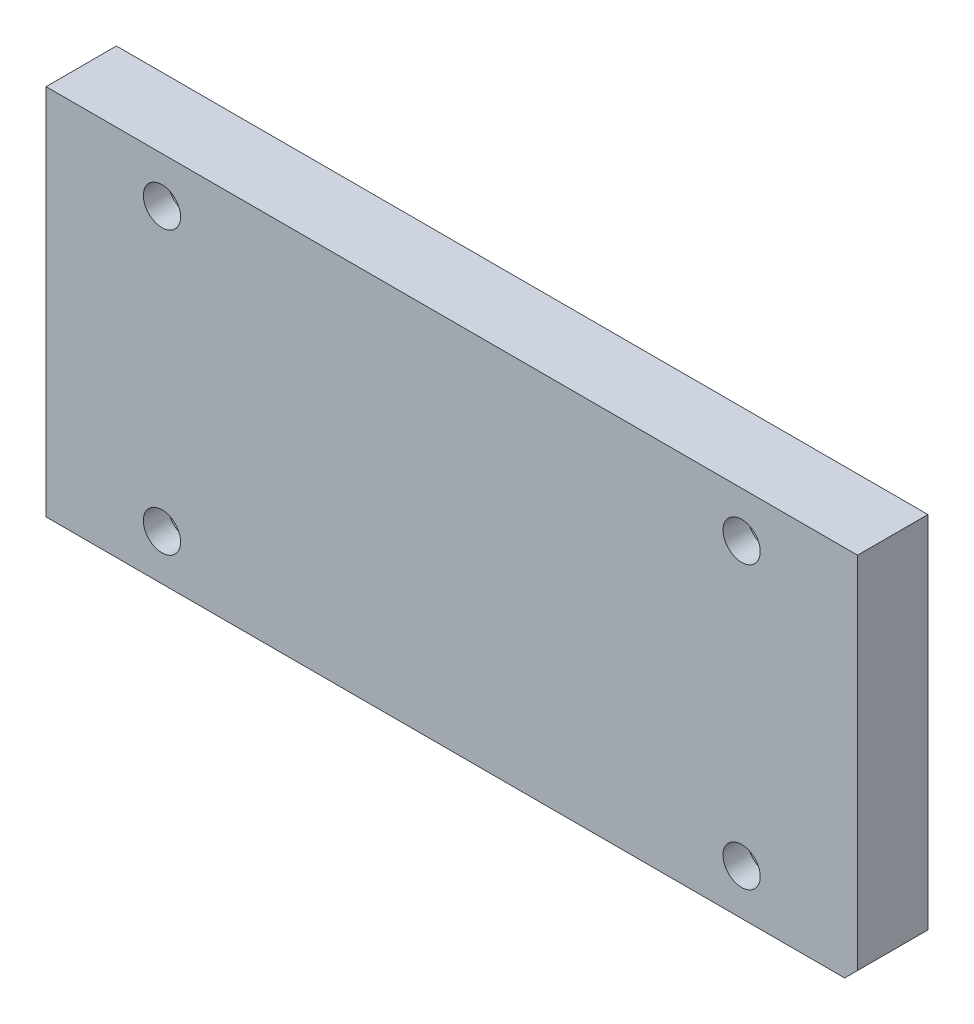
ISO-10303-21;
HEADER;
FILE_DESCRIPTION(('STEP AP214'),'2;1');
FILE_NAME('part.step','',(''),(''),'','','');
FILE_SCHEMA(('AUTOMOTIVE_DESIGN { 1 0 10303 214 1 1 1 1 }'));
ENDSEC;
DATA;
#1=APPLICATION_CONTEXT('core data for automotive mechanical design processes');
#2=APPLICATION_PROTOCOL_DEFINITION('international standard','automotive_design',2000,#1);
#3=PRODUCT_CONTEXT('',#1,'mechanical');
#4=PRODUCT('Part','Part','',(#3));
#5=PRODUCT_RELATED_PRODUCT_CATEGORY('part','',(#4));
#6=PRODUCT_DEFINITION_FORMATION('','',#4);
#7=PRODUCT_DEFINITION_CONTEXT('part definition',#1,'design');
#8=PRODUCT_DEFINITION('design','',#6,#7);
#9=PRODUCT_DEFINITION_SHAPE('','',#8);
#10=(LENGTH_UNIT() NAMED_UNIT(*) SI_UNIT(.MILLI.,.METRE.));
#11=(NAMED_UNIT(*) PLANE_ANGLE_UNIT() SI_UNIT($,.RADIAN.));
#12=(NAMED_UNIT(*) SI_UNIT($,.STERADIAN.) SOLID_ANGLE_UNIT());
#13=UNCERTAINTY_MEASURE_WITH_UNIT(LENGTH_MEASURE(1.E-05),#10,'distance_accuracy_value','');
#14=(GEOMETRIC_REPRESENTATION_CONTEXT(3) GLOBAL_UNCERTAINTY_ASSIGNED_CONTEXT((#13)) GLOBAL_UNIT_ASSIGNED_CONTEXT((#10,
#11,#12)) REPRESENTATION_CONTEXT('',''));
#15=CARTESIAN_POINT('',(0.,0.,0.));
#16=DIRECTION('',(0.,0.,1.));
#17=DIRECTION('',(1.,0.,0.));
#18=AXIS2_PLACEMENT_3D('',#15,#16,#17);
#19=CARTESIAN_POINT('',(-98.,-45.,-232.675682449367));
#20=DIRECTION('',(-1.,0.,0.));
#21=DIRECTION('',(0.,0.,1.));
#22=AXIS2_PLACEMENT_3D('',#19,#20,#21);
#23=PLANE('',#22);
#24=DIRECTION('',(0.,1.,0.));
#25=VECTOR('',#24,1.);
#26=CARTESIAN_POINT('',(-98.,-45.,-17.));
#27=LINE('',#26,#25);
#28=CARTESIAN_POINT('',(-98.,-45.,-17.));
#29=VERTEX_POINT('',#28);
#30=CARTESIAN_POINT('',(-98.,45.,-17.));
#31=VERTEX_POINT('',#30);
#32=EDGE_CURVE('E197',#29,#31,#27,.T.);
#33=ORIENTED_EDGE('',*,*,#32,.F.);
#34=DIRECTION('',(0.,0.,1.));
#35=VECTOR('',#34,1.);
#36=CARTESIAN_POINT('',(-98.,-45.,-232.675682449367));
#37=LINE('',#36,#35);
#38=CARTESIAN_POINT('',(-98.,-45.,0.));
#39=VERTEX_POINT('',#38);
#40=EDGE_CURVE('E209',#29,#39,#37,.T.);
#41=ORIENTED_EDGE('',*,*,#40,.T.);
#42=DIRECTION('',(0.,-1.,0.));
#43=VECTOR('',#42,1.);
#44=CARTESIAN_POINT('',(-98.,-45.,0.));
#45=LINE('',#44,#43);
#46=CARTESIAN_POINT('',(-98.,45.,0.));
#47=VERTEX_POINT('',#46);
#48=EDGE_CURVE('E191',#47,#39,#45,.T.);
#49=ORIENTED_EDGE('',*,*,#48,.F.);
#50=DIRECTION('',(0.,0.,1.));
#51=VECTOR('',#50,1.);
#52=CARTESIAN_POINT('',(-98.,45.,-232.675682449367));
#53=LINE('',#52,#51);
#54=EDGE_CURVE('E195',#31,#47,#53,.T.);
#55=ORIENTED_EDGE('',*,*,#54,.F.);
#56=EDGE_LOOP('',(#33,#41,#49,#55));
#57=FACE_BOUND('',#56,.T.);
#58=ADVANCED_FACE('F34',(#57),#23,.T.);
#59=CARTESIAN_POINT('',(-98.,45.,-232.675682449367));
#60=DIRECTION('',(0.,1.,0.));
#61=DIRECTION('',(0.,0.,1.));
#62=AXIS2_PLACEMENT_3D('',#59,#60,#61);
#63=PLANE('',#62);
#64=DIRECTION('',(1.,0.,0.));
#65=VECTOR('',#64,1.);
#66=CARTESIAN_POINT('',(-98.,45.,-17.));
#67=LINE('',#66,#65);
#68=CARTESIAN_POINT('',(98.,45.,-17.));
#69=VERTEX_POINT('',#68);
#70=EDGE_CURVE('E194',#31,#69,#67,.T.);
#71=ORIENTED_EDGE('',*,*,#70,.F.);
#72=ORIENTED_EDGE('',*,*,#54,.T.);
#73=DIRECTION('',(-1.,0.,0.));
#74=VECTOR('',#73,1.);
#75=CARTESIAN_POINT('',(-98.,45.,0.));
#76=LINE('',#75,#74);
#77=CARTESIAN_POINT('',(98.,45.,0.));
#78=VERTEX_POINT('',#77);
#79=EDGE_CURVE('E206',#78,#47,#76,.T.);
#80=ORIENTED_EDGE('',*,*,#79,.F.);
#81=DIRECTION('',(0.,0.,1.));
#82=VECTOR('',#81,1.);
#83=CARTESIAN_POINT('',(98.,45.,-232.675682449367));
#84=LINE('',#83,#82);
#85=EDGE_CURVE('E211',#69,#78,#84,.T.);
#86=ORIENTED_EDGE('',*,*,#85,.F.);
#87=EDGE_LOOP('',(#71,#72,#80,#86));
#88=FACE_BOUND('',#87,.T.);
#89=ADVANCED_FACE('F238',(#88),#63,.T.);
#90=CARTESIAN_POINT('',(98.,-45.,-232.675682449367));
#91=DIRECTION('',(1.,0.,0.));
#92=DIRECTION('',(0.,1.,0.));
#93=AXIS2_PLACEMENT_3D('',#90,#91,#92);
#94=PLANE('',#93);
#95=DIRECTION('',(0.,1.,0.));
#96=VECTOR('',#95,1.);
#97=CARTESIAN_POINT('',(98.,-45.,0.));
#98=LINE('',#97,#96);
#99=CARTESIAN_POINT('',(98.,-41.88,0.));
#100=VERTEX_POINT('',#99);
#101=EDGE_CURVE('E204',#100,#78,#98,.T.);
#102=ORIENTED_EDGE('',*,*,#101,.F.);
#103=DIRECTION('',(0.,0.,-1.));
#104=VECTOR('',#103,1.);
#105=CARTESIAN_POINT('',(98.,-41.88,-232.675682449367));
#106=LINE('',#105,#104);
#107=CARTESIAN_POINT('',(98.,-41.88,-17.));
#108=VERTEX_POINT('',#107);
#109=EDGE_CURVE('E42',#100,#108,#106,.T.);
#110=ORIENTED_EDGE('',*,*,#109,.T.);
#111=DIRECTION('',(0.,-1.,0.));
#112=VECTOR('',#111,1.);
#113=CARTESIAN_POINT('',(98.,-45.,-17.));
#114=LINE('',#113,#112);
#115=EDGE_CURVE('E192',#69,#108,#114,.T.);
#116=ORIENTED_EDGE('',*,*,#115,.F.);
#117=ORIENTED_EDGE('',*,*,#85,.T.);
#118=EDGE_LOOP('',(#102,#110,#116,#117));
#119=FACE_BOUND('',#118,.T.);
#120=ADVANCED_FACE('F239',(#119),#94,.T.);
#121=CARTESIAN_POINT('',(-98.,-45.,-232.675682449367));
#122=DIRECTION('',(0.,-1.,0.));
#123=DIRECTION('',(1.,0.,0.));
#124=AXIS2_PLACEMENT_3D('',#121,#122,#123);
#125=PLANE('',#124);
#126=DIRECTION('',(-1.,0.,0.));
#127=VECTOR('',#126,1.);
#128=CARTESIAN_POINT('',(-98.,-45.,-17.));
#129=LINE('',#128,#127);
#130=CARTESIAN_POINT('',(94.88,-45.,-17.));
#131=VERTEX_POINT('',#130);
#132=EDGE_CURVE('E199',#131,#29,#129,.T.);
#133=ORIENTED_EDGE('',*,*,#132,.F.);
#134=DIRECTION('',(0.,0.,1.));
#135=VECTOR('',#134,1.);
#136=CARTESIAN_POINT('',(94.88,-45.,-232.675682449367));
#137=LINE('',#136,#135);
#138=CARTESIAN_POINT('',(94.88,-45.,0.));
#139=VERTEX_POINT('',#138);
#140=EDGE_CURVE('E216',#131,#139,#137,.T.);
#141=ORIENTED_EDGE('',*,*,#140,.T.);
#142=DIRECTION('',(1.,0.,0.));
#143=VECTOR('',#142,1.);
#144=CARTESIAN_POINT('',(-98.,-45.,0.));
#145=LINE('',#144,#143);
#146=EDGE_CURVE('E202',#39,#139,#145,.T.);
#147=ORIENTED_EDGE('',*,*,#146,.F.);
#148=ORIENTED_EDGE('',*,*,#40,.F.);
#149=EDGE_LOOP('',(#133,#141,#147,#148));
#150=FACE_BOUND('',#149,.T.);
#151=ADVANCED_FACE('F223',(#150),#125,.T.);
#152=CARTESIAN_POINT('',(0.,0.,0.));
#153=DIRECTION('',(0.,0.,-1.));
#154=DIRECTION('',(-1.,0.,0.));
#155=AXIS2_PLACEMENT_3D('',#152,#153,#154);
#156=PLANE('',#155);
#157=CARTESIAN_POINT('',(70.,-34.,0.));
#158=DIRECTION('',(0.,0.,-1.));
#159=DIRECTION('',(-1.,0.,0.));
#160=AXIS2_PLACEMENT_3D('',#157,#158,#159);
#161=CIRCLE('',#160,4.5);
#162=CARTESIAN_POINT('',(65.5,-34.,0.));
#163=VERTEX_POINT('',#162);
#164=EDGE_CURVE('E152',#163,#163,#161,.T.);
#165=ORIENTED_EDGE('',*,*,#164,.T.);
#166=EDGE_LOOP('',(#165));
#167=FACE_BOUND('',#166,.T.);
#168=CARTESIAN_POINT('',(-70.,-34.,0.));
#169=DIRECTION('',(0.,0.,-1.));
#170=DIRECTION('',(-1.,0.,0.));
#171=AXIS2_PLACEMENT_3D('',#168,#169,#170);
#172=CIRCLE('',#171,4.5);
#173=CARTESIAN_POINT('',(-74.5,-34.,0.));
#174=VERTEX_POINT('',#173);
#175=EDGE_CURVE('E164',#174,#174,#172,.T.);
#176=ORIENTED_EDGE('',*,*,#175,.T.);
#177=EDGE_LOOP('',(#176));
#178=FACE_BOUND('',#177,.T.);
#179=CARTESIAN_POINT('',(-70.,34.,0.));
#180=DIRECTION('',(0.,0.,-1.));
#181=DIRECTION('',(-1.,0.,0.));
#182=AXIS2_PLACEMENT_3D('',#179,#180,#181);
#183=CIRCLE('',#182,4.5);
#184=CARTESIAN_POINT('',(-74.5,34.,0.));
#185=VERTEX_POINT('',#184);
#186=EDGE_CURVE('E176',#185,#185,#183,.T.);
#187=ORIENTED_EDGE('',*,*,#186,.T.);
#188=EDGE_LOOP('',(#187));
#189=FACE_BOUND('',#188,.T.);
#190=CARTESIAN_POINT('',(70.,34.,0.));
#191=DIRECTION('',(0.,0.,-1.));
#192=DIRECTION('',(-1.,0.,0.));
#193=AXIS2_PLACEMENT_3D('',#190,#191,#192);
#194=CIRCLE('',#193,4.5);
#195=CARTESIAN_POINT('',(65.5,34.,0.));
#196=VERTEX_POINT('',#195);
#197=EDGE_CURVE('E188',#196,#196,#194,.T.);
#198=ORIENTED_EDGE('',*,*,#197,.T.);
#199=EDGE_LOOP('',(#198));
#200=FACE_BOUND('',#199,.T.);
#201=ORIENTED_EDGE('',*,*,#146,.T.);
#202=DIRECTION('',(-0.707106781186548,-0.707106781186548,0.));
#203=VECTOR('',#202,1.);
#204=CARTESIAN_POINT('',(94.88,-45.,0.));
#205=LINE('',#204,#203);
#206=EDGE_CURVE('E56',#139,#100,#205,.F.);
#207=ORIENTED_EDGE('',*,*,#206,.T.);
#208=ORIENTED_EDGE('',*,*,#101,.T.);
#209=ORIENTED_EDGE('',*,*,#79,.T.);
#210=ORIENTED_EDGE('',*,*,#48,.T.);
#211=EDGE_LOOP('',(#201,#207,#208,#209,#210));
#212=FACE_BOUND('',#211,.T.);
#213=ADVANCED_FACE('F227',(#167,#178,#189,#200,#212),#156,.F.);
#214=CARTESIAN_POINT('',(0.,0.,-17.));
#215=DIRECTION('',(0.,0.,1.));
#216=DIRECTION('',(1.,0.,0.));
#217=AXIS2_PLACEMENT_3D('',#214,#215,#216);
#218=PLANE('',#217);
#219=CARTESIAN_POINT('',(86.,-34.,-17.0000000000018));
#220=DIRECTION('',(0.,0.,-1.));
#221=DIRECTION('',(-1.,0.,0.));
#222=AXIS2_PLACEMENT_3D('',#219,#220,#221);
#223=CIRCLE('',#222,2.);
#224=CARTESIAN_POINT('',(84.,-34.,-17.0000000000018));
#225=VERTEX_POINT('',#224);
#226=EDGE_CURVE('E369',#225,#225,#223,.T.);
#227=ORIENTED_EDGE('',*,*,#226,.F.);
#228=EDGE_LOOP('',(#227));
#229=FACE_BOUND('',#228,.T.);
#230=CARTESIAN_POINT('',(-86.0000000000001,-34.,-17.0000000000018));
#231=DIRECTION('',(0.,0.,-1.));
#232=DIRECTION('',(-1.,0.,0.));
#233=AXIS2_PLACEMENT_3D('',#230,#231,#232);
#234=CIRCLE('',#233,2.);
#235=CARTESIAN_POINT('',(-88.0000000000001,-34.,-17.0000000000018));
#236=VERTEX_POINT('',#235);
#237=EDGE_CURVE('E100',#236,#236,#234,.T.);
#238=ORIENTED_EDGE('',*,*,#237,.F.);
#239=EDGE_LOOP('',(#238));
#240=FACE_BOUND('',#239,.T.);
#241=CARTESIAN_POINT('',(-86.0000000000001,34.,-17.0000000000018));
#242=DIRECTION('',(0.,0.,-1.));
#243=DIRECTION('',(-1.,0.,0.));
#244=AXIS2_PLACEMENT_3D('',#241,#242,#243);
#245=CIRCLE('',#244,2.);
#246=CARTESIAN_POINT('',(-88.0000000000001,34.,-17.0000000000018));
#247=VERTEX_POINT('',#246);
#248=EDGE_CURVE('E119',#247,#247,#245,.T.);
#249=ORIENTED_EDGE('',*,*,#248,.F.);
#250=EDGE_LOOP('',(#249));
#251=FACE_BOUND('',#250,.T.);
#252=CARTESIAN_POINT('',(86.,34.,-17.0000000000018));
#253=DIRECTION('',(0.,0.,-1.));
#254=DIRECTION('',(-1.,0.,0.));
#255=AXIS2_PLACEMENT_3D('',#252,#253,#254);
#256=CIRCLE('',#255,2.);
#257=CARTESIAN_POINT('',(84.,34.,-17.0000000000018));
#258=VERTEX_POINT('',#257);
#259=EDGE_CURVE('E131',#258,#258,#256,.T.);
#260=ORIENTED_EDGE('',*,*,#259,.F.);
#261=EDGE_LOOP('',(#260));
#262=FACE_BOUND('',#261,.T.);
#263=CARTESIAN_POINT('',(70.,-34.,-17.));
#264=DIRECTION('',(0.,0.,-1.));
#265=DIRECTION('',(-1.,0.,0.));
#266=AXIS2_PLACEMENT_3D('',#263,#264,#265);
#267=CIRCLE('',#266,7.50000000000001);
#268=CARTESIAN_POINT('',(62.5,-34.,-17.));
#269=VERTEX_POINT('',#268);
#270=EDGE_CURVE('E143',#269,#269,#267,.T.);
#271=ORIENTED_EDGE('',*,*,#270,.F.);
#272=EDGE_LOOP('',(#271));
#273=FACE_BOUND('',#272,.T.);
#274=CARTESIAN_POINT('',(-70.,-34.,-17.));
#275=DIRECTION('',(0.,0.,-1.));
#276=DIRECTION('',(-1.,0.,0.));
#277=AXIS2_PLACEMENT_3D('',#274,#275,#276);
#278=CIRCLE('',#277,7.50000000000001);
#279=CARTESIAN_POINT('',(-77.5,-34.,-17.));
#280=VERTEX_POINT('',#279);
#281=EDGE_CURVE('E155',#280,#280,#278,.T.);
#282=ORIENTED_EDGE('',*,*,#281,.F.);
#283=EDGE_LOOP('',(#282));
#284=FACE_BOUND('',#283,.T.);
#285=CARTESIAN_POINT('',(-70.,34.,-17.));
#286=DIRECTION('',(0.,0.,-1.));
#287=DIRECTION('',(-1.,0.,0.));
#288=AXIS2_PLACEMENT_3D('',#285,#286,#287);
#289=CIRCLE('',#288,7.50000000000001);
#290=CARTESIAN_POINT('',(-77.5,34.,-17.));
#291=VERTEX_POINT('',#290);
#292=EDGE_CURVE('E167',#291,#291,#289,.T.);
#293=ORIENTED_EDGE('',*,*,#292,.F.);
#294=EDGE_LOOP('',(#293));
#295=FACE_BOUND('',#294,.T.);
#296=CARTESIAN_POINT('',(70.,34.,-17.));
#297=DIRECTION('',(0.,0.,-1.));
#298=DIRECTION('',(-1.,0.,0.));
#299=AXIS2_PLACEMENT_3D('',#296,#297,#298);
#300=CIRCLE('',#299,7.50000000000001);
#301=CARTESIAN_POINT('',(62.5,34.,-17.));
#302=VERTEX_POINT('',#301);
#303=EDGE_CURVE('E179',#302,#302,#300,.T.);
#304=ORIENTED_EDGE('',*,*,#303,.F.);
#305=EDGE_LOOP('',(#304));
#306=FACE_BOUND('',#305,.T.);
#307=ORIENTED_EDGE('',*,*,#115,.T.);
#308=DIRECTION('',(0.707106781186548,0.707106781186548,0.));
#309=VECTOR('',#308,1.);
#310=CARTESIAN_POINT('',(94.88,-45.,-17.));
#311=LINE('',#310,#309);
#312=EDGE_CURVE('E11',#108,#131,#311,.F.);
#313=ORIENTED_EDGE('',*,*,#312,.T.);
#314=ORIENTED_EDGE('',*,*,#132,.T.);
#315=ORIENTED_EDGE('',*,*,#32,.T.);
#316=ORIENTED_EDGE('',*,*,#70,.T.);
#317=EDGE_LOOP('',(#307,#313,#314,#315,#316));
#318=FACE_BOUND('',#317,.T.);
#319=ADVANCED_FACE('F235',(#229,#240,#251,#262,#273,#284,#295,#306,#318),#218,.F.);
#320=CARTESIAN_POINT('',(70.,34.,-17.));
#321=DIRECTION('',(0.,0.,-1.));
#322=DIRECTION('',(-1.,0.,0.));
#323=AXIS2_PLACEMENT_3D('',#320,#321,#322);
#324=CYLINDRICAL_SURFACE('',#323,4.5);
#325=ORIENTED_EDGE('',*,*,#197,.F.);
#326=EDGE_LOOP('',(#325));
#327=FACE_BOUND('',#326,.T.);
#328=CARTESIAN_POINT('',(70.,34.,-6.));
#329=DIRECTION('',(0.,0.,-1.));
#330=DIRECTION('',(-1.,0.,0.));
#331=AXIS2_PLACEMENT_3D('',#328,#329,#330);
#332=CIRCLE('',#331,4.5);
#333=CARTESIAN_POINT('',(65.5,34.,-6.));
#334=VERTEX_POINT('',#333);
#335=EDGE_CURVE('E185',#334,#334,#332,.T.);
#336=ORIENTED_EDGE('',*,*,#335,.T.);
#337=EDGE_LOOP('',(#336));
#338=FACE_BOUND('',#337,.T.);
#339=ADVANCED_FACE('F263',(#327,#338),#324,.F.);
#340=CARTESIAN_POINT('',(74.5,34.,-6.));
#341=DIRECTION('',(0.,0.,1.));
#342=DIRECTION('',(1.,0.,0.));
#343=AXIS2_PLACEMENT_3D('',#340,#341,#342);
#344=PLANE('',#343);
#345=ORIENTED_EDGE('',*,*,#335,.F.);
#346=EDGE_LOOP('',(#345));
#347=FACE_BOUND('',#346,.T.);
#348=CARTESIAN_POINT('',(70.,34.,-6.));
#349=DIRECTION('',(0.,0.,-1.));
#350=DIRECTION('',(-1.,0.,0.));
#351=AXIS2_PLACEMENT_3D('',#348,#349,#350);
#352=CIRCLE('',#351,7.50000000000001);
#353=CARTESIAN_POINT('',(62.5,34.,-6.));
#354=VERTEX_POINT('',#353);
#355=EDGE_CURVE('E182',#354,#354,#352,.T.);
#356=ORIENTED_EDGE('',*,*,#355,.T.);
#357=EDGE_LOOP('',(#356));
#358=FACE_BOUND('',#357,.T.);
#359=ADVANCED_FACE('F267',(#347,#358),#344,.F.);
#360=CARTESIAN_POINT('',(70.,34.,-17.));
#361=DIRECTION('',(0.,0.,-1.));
#362=DIRECTION('',(-1.,0.,0.));
#363=AXIS2_PLACEMENT_3D('',#360,#361,#362);
#364=CYLINDRICAL_SURFACE('',#363,7.50000000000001);
#365=ORIENTED_EDGE('',*,*,#355,.F.);
#366=EDGE_LOOP('',(#365));
#367=FACE_BOUND('',#366,.T.);
#368=ORIENTED_EDGE('',*,*,#303,.T.);
#369=EDGE_LOOP('',(#368));
#370=FACE_BOUND('',#369,.T.);
#371=ADVANCED_FACE('F271',(#367,#370),#364,.F.);
#372=CARTESIAN_POINT('',(-70.,34.,-17.));
#373=DIRECTION('',(0.,0.,-1.));
#374=DIRECTION('',(-1.,0.,0.));
#375=AXIS2_PLACEMENT_3D('',#372,#373,#374);
#376=CYLINDRICAL_SURFACE('',#375,4.5);
#377=ORIENTED_EDGE('',*,*,#186,.F.);
#378=EDGE_LOOP('',(#377));
#379=FACE_BOUND('',#378,.T.);
#380=CARTESIAN_POINT('',(-70.,34.,-6.));
#381=DIRECTION('',(0.,0.,-1.));
#382=DIRECTION('',(-1.,0.,0.));
#383=AXIS2_PLACEMENT_3D('',#380,#381,#382);
#384=CIRCLE('',#383,4.5);
#385=CARTESIAN_POINT('',(-74.5,34.,-6.));
#386=VERTEX_POINT('',#385);
#387=EDGE_CURVE('E173',#386,#386,#384,.T.);
#388=ORIENTED_EDGE('',*,*,#387,.T.);
#389=EDGE_LOOP('',(#388));
#390=FACE_BOUND('',#389,.T.);
#391=ADVANCED_FACE('F275',(#379,#390),#376,.F.);
#392=CARTESIAN_POINT('',(-65.5,34.,-6.));
#393=DIRECTION('',(0.,0.,1.));
#394=DIRECTION('',(1.,0.,0.));
#395=AXIS2_PLACEMENT_3D('',#392,#393,#394);
#396=PLANE('',#395);
#397=ORIENTED_EDGE('',*,*,#387,.F.);
#398=EDGE_LOOP('',(#397));
#399=FACE_BOUND('',#398,.T.);
#400=CARTESIAN_POINT('',(-70.,34.,-6.));
#401=DIRECTION('',(0.,0.,-1.));
#402=DIRECTION('',(-1.,0.,0.));
#403=AXIS2_PLACEMENT_3D('',#400,#401,#402);
#404=CIRCLE('',#403,7.50000000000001);
#405=CARTESIAN_POINT('',(-77.5,34.,-6.));
#406=VERTEX_POINT('',#405);
#407=EDGE_CURVE('E170',#406,#406,#404,.T.);
#408=ORIENTED_EDGE('',*,*,#407,.T.);
#409=EDGE_LOOP('',(#408));
#410=FACE_BOUND('',#409,.T.);
#411=ADVANCED_FACE('F279',(#399,#410),#396,.F.);
#412=CARTESIAN_POINT('',(-70.,34.,-17.));
#413=DIRECTION('',(0.,0.,-1.));
#414=DIRECTION('',(-1.,0.,0.));
#415=AXIS2_PLACEMENT_3D('',#412,#413,#414);
#416=CYLINDRICAL_SURFACE('',#415,7.50000000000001);
#417=ORIENTED_EDGE('',*,*,#407,.F.);
#418=EDGE_LOOP('',(#417));
#419=FACE_BOUND('',#418,.T.);
#420=ORIENTED_EDGE('',*,*,#292,.T.);
#421=EDGE_LOOP('',(#420));
#422=FACE_BOUND('',#421,.T.);
#423=ADVANCED_FACE('F283',(#419,#422),#416,.F.);
#424=CARTESIAN_POINT('',(-70.,-34.,-17.));
#425=DIRECTION('',(0.,0.,-1.));
#426=DIRECTION('',(-1.,0.,0.));
#427=AXIS2_PLACEMENT_3D('',#424,#425,#426);
#428=CYLINDRICAL_SURFACE('',#427,4.5);
#429=ORIENTED_EDGE('',*,*,#175,.F.);
#430=EDGE_LOOP('',(#429));
#431=FACE_BOUND('',#430,.T.);
#432=CARTESIAN_POINT('',(-70.,-34.,-6.));
#433=DIRECTION('',(0.,0.,-1.));
#434=DIRECTION('',(-1.,0.,0.));
#435=AXIS2_PLACEMENT_3D('',#432,#433,#434);
#436=CIRCLE('',#435,4.5);
#437=CARTESIAN_POINT('',(-74.5,-34.,-6.));
#438=VERTEX_POINT('',#437);
#439=EDGE_CURVE('E161',#438,#438,#436,.T.);
#440=ORIENTED_EDGE('',*,*,#439,.T.);
#441=EDGE_LOOP('',(#440));
#442=FACE_BOUND('',#441,.T.);
#443=ADVANCED_FACE('F287',(#431,#442),#428,.F.);
#444=CARTESIAN_POINT('',(-65.5,-34.,-6.));
#445=DIRECTION('',(0.,0.,1.));
#446=DIRECTION('',(1.,0.,0.));
#447=AXIS2_PLACEMENT_3D('',#444,#445,#446);
#448=PLANE('',#447);
#449=ORIENTED_EDGE('',*,*,#439,.F.);
#450=EDGE_LOOP('',(#449));
#451=FACE_BOUND('',#450,.T.);
#452=CARTESIAN_POINT('',(-70.,-34.,-6.));
#453=DIRECTION('',(0.,0.,-1.));
#454=DIRECTION('',(-1.,0.,0.));
#455=AXIS2_PLACEMENT_3D('',#452,#453,#454);
#456=CIRCLE('',#455,7.50000000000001);
#457=CARTESIAN_POINT('',(-77.5,-34.,-6.));
#458=VERTEX_POINT('',#457);
#459=EDGE_CURVE('E158',#458,#458,#456,.T.);
#460=ORIENTED_EDGE('',*,*,#459,.T.);
#461=EDGE_LOOP('',(#460));
#462=FACE_BOUND('',#461,.T.);
#463=ADVANCED_FACE('F291',(#451,#462),#448,.F.);
#464=CARTESIAN_POINT('',(-70.,-34.,-17.));
#465=DIRECTION('',(0.,0.,-1.));
#466=DIRECTION('',(-1.,0.,0.));
#467=AXIS2_PLACEMENT_3D('',#464,#465,#466);
#468=CYLINDRICAL_SURFACE('',#467,7.50000000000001);
#469=ORIENTED_EDGE('',*,*,#459,.F.);
#470=EDGE_LOOP('',(#469));
#471=FACE_BOUND('',#470,.T.);
#472=ORIENTED_EDGE('',*,*,#281,.T.);
#473=EDGE_LOOP('',(#472));
#474=FACE_BOUND('',#473,.T.);
#475=ADVANCED_FACE('F295',(#471,#474),#468,.F.);
#476=CARTESIAN_POINT('',(70.,-34.,-17.));
#477=DIRECTION('',(0.,0.,-1.));
#478=DIRECTION('',(-1.,0.,0.));
#479=AXIS2_PLACEMENT_3D('',#476,#477,#478);
#480=CYLINDRICAL_SURFACE('',#479,4.5);
#481=ORIENTED_EDGE('',*,*,#164,.F.);
#482=EDGE_LOOP('',(#481));
#483=FACE_BOUND('',#482,.T.);
#484=CARTESIAN_POINT('',(70.,-34.,-6.));
#485=DIRECTION('',(0.,0.,-1.));
#486=DIRECTION('',(-1.,0.,0.));
#487=AXIS2_PLACEMENT_3D('',#484,#485,#486);
#488=CIRCLE('',#487,4.5);
#489=CARTESIAN_POINT('',(65.5,-34.,-6.));
#490=VERTEX_POINT('',#489);
#491=EDGE_CURVE('E149',#490,#490,#488,.T.);
#492=ORIENTED_EDGE('',*,*,#491,.T.);
#493=EDGE_LOOP('',(#492));
#494=FACE_BOUND('',#493,.T.);
#495=ADVANCED_FACE('F299',(#483,#494),#480,.F.);
#496=CARTESIAN_POINT('',(74.5,-34.,-6.));
#497=DIRECTION('',(0.,0.,1.));
#498=DIRECTION('',(1.,0.,0.));
#499=AXIS2_PLACEMENT_3D('',#496,#497,#498);
#500=PLANE('',#499);
#501=ORIENTED_EDGE('',*,*,#491,.F.);
#502=EDGE_LOOP('',(#501));
#503=FACE_BOUND('',#502,.T.);
#504=CARTESIAN_POINT('',(70.,-34.,-6.));
#505=DIRECTION('',(0.,0.,-1.));
#506=DIRECTION('',(-1.,0.,0.));
#507=AXIS2_PLACEMENT_3D('',#504,#505,#506);
#508=CIRCLE('',#507,7.50000000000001);
#509=CARTESIAN_POINT('',(62.5,-34.,-6.));
#510=VERTEX_POINT('',#509);
#511=EDGE_CURVE('E146',#510,#510,#508,.T.);
#512=ORIENTED_EDGE('',*,*,#511,.T.);
#513=EDGE_LOOP('',(#512));
#514=FACE_BOUND('',#513,.T.);
#515=ADVANCED_FACE('F303',(#503,#514),#500,.F.);
#516=CARTESIAN_POINT('',(70.,-34.,-17.));
#517=DIRECTION('',(0.,0.,-1.));
#518=DIRECTION('',(-1.,0.,0.));
#519=AXIS2_PLACEMENT_3D('',#516,#517,#518);
#520=CYLINDRICAL_SURFACE('',#519,7.50000000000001);
#521=ORIENTED_EDGE('',*,*,#511,.F.);
#522=EDGE_LOOP('',(#521));
#523=FACE_BOUND('',#522,.T.);
#524=ORIENTED_EDGE('',*,*,#270,.T.);
#525=EDGE_LOOP('',(#524));
#526=FACE_BOUND('',#525,.T.);
#527=ADVANCED_FACE('F307',(#523,#526),#520,.F.);
#528=CARTESIAN_POINT('',(86.,34.,-5.9914200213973));
#529=DIRECTION('',(0.,0.,-1.));
#530=DIRECTION('',(-1.,0.,0.));
#531=AXIS2_PLACEMENT_3D('',#528,#529,#530);
#532=CONICAL_SURFACE('',#531,1.65,1.02974425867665);
#533=CARTESIAN_POINT('',(86.,34.,-5.00000000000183));
#534=VERTEX_POINT('',#533);
#535=VERTEX_LOOP('',#534);
#536=FACE_BOUND('',#535,.T.);
#537=CARTESIAN_POINT('',(86.,34.,-5.9914200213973));
#538=DIRECTION('',(0.,0.,-1.));
#539=DIRECTION('',(-1.,0.,0.));
#540=AXIS2_PLACEMENT_3D('',#537,#538,#539);
#541=CIRCLE('',#540,1.65);
#542=CARTESIAN_POINT('',(84.35,34.,-5.9914200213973));
#543=VERTEX_POINT('',#542);
#544=EDGE_CURVE('E140',#543,#543,#541,.T.);
#545=ORIENTED_EDGE('',*,*,#544,.T.);
#546=EDGE_LOOP('',(#545));
#547=FACE_BOUND('',#546,.T.);
#548=ADVANCED_FACE('F311',(#536,#547),#532,.F.);
#549=CARTESIAN_POINT('',(86.,34.,-17.0000000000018));
#550=DIRECTION('',(0.,0.,-1.));
#551=DIRECTION('',(-1.,0.,0.));
#552=AXIS2_PLACEMENT_3D('',#549,#550,#551);
#553=CYLINDRICAL_SURFACE('',#552,1.65);
#554=ORIENTED_EDGE('',*,*,#544,.F.);
#555=EDGE_LOOP('',(#554));
#556=FACE_BOUND('',#555,.T.);
#557=CARTESIAN_POINT('',(86.,34.,-10.0000000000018));
#558=DIRECTION('',(0.,0.,-1.));
#559=DIRECTION('',(-1.,0.,0.));
#560=AXIS2_PLACEMENT_3D('',#557,#558,#559);
#561=CIRCLE('',#560,1.65);
#562=CARTESIAN_POINT('',(84.35,34.,-10.0000000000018));
#563=VERTEX_POINT('',#562);
#564=EDGE_CURVE('E137',#563,#563,#561,.T.);
#565=ORIENTED_EDGE('',*,*,#564,.T.);
#566=EDGE_LOOP('',(#565));
#567=FACE_BOUND('',#566,.T.);
#568=ADVANCED_FACE('F315',(#556,#567),#553,.F.);
#569=CARTESIAN_POINT('',(87.65,34.,-10.0000000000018));
#570=DIRECTION('',(0.,0.,1.));
#571=DIRECTION('',(1.,0.,0.));
#572=AXIS2_PLACEMENT_3D('',#569,#570,#571);
#573=PLANE('',#572);
#574=ORIENTED_EDGE('',*,*,#564,.F.);
#575=EDGE_LOOP('',(#574));
#576=FACE_BOUND('',#575,.T.);
#577=CARTESIAN_POINT('',(86.,34.,-10.0000000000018));
#578=DIRECTION('',(0.,0.,-1.));
#579=DIRECTION('',(-1.,0.,0.));
#580=AXIS2_PLACEMENT_3D('',#577,#578,#579);
#581=CIRCLE('',#580,2.);
#582=CARTESIAN_POINT('',(84.,34.,-10.0000000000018));
#583=VERTEX_POINT('',#582);
#584=EDGE_CURVE('E134',#583,#583,#581,.T.);
#585=ORIENTED_EDGE('',*,*,#584,.T.);
#586=EDGE_LOOP('',(#585));
#587=FACE_BOUND('',#586,.T.);
#588=ADVANCED_FACE('F319',(#576,#587),#573,.F.);
#589=CARTESIAN_POINT('',(86.,34.,-17.0000000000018));
#590=DIRECTION('',(0.,0.,-1.));
#591=DIRECTION('',(-1.,0.,0.));
#592=AXIS2_PLACEMENT_3D('',#589,#590,#591);
#593=CYLINDRICAL_SURFACE('',#592,2.);
#594=ORIENTED_EDGE('',*,*,#584,.F.);
#595=EDGE_LOOP('',(#594));
#596=FACE_BOUND('',#595,.T.);
#597=ORIENTED_EDGE('',*,*,#259,.T.);
#598=EDGE_LOOP('',(#597));
#599=FACE_BOUND('',#598,.T.);
#600=ADVANCED_FACE('F323',(#596,#599),#593,.F.);
#601=CARTESIAN_POINT('',(-86.0000000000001,34.,-5.9914200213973));
#602=DIRECTION('',(0.,0.,-1.));
#603=DIRECTION('',(-1.,0.,0.));
#604=AXIS2_PLACEMENT_3D('',#601,#602,#603);
#605=CONICAL_SURFACE('',#604,1.65,1.02974425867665);
#606=CARTESIAN_POINT('',(-86.0000000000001,34.,-5.00000000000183));
#607=VERTEX_POINT('',#606);
#608=VERTEX_LOOP('',#607);
#609=FACE_BOUND('',#608,.T.);
#610=CARTESIAN_POINT('',(-86.0000000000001,34.,-5.9914200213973));
#611=DIRECTION('',(0.,0.,-1.));
#612=DIRECTION('',(-1.,0.,0.));
#613=AXIS2_PLACEMENT_3D('',#610,#611,#612);
#614=CIRCLE('',#613,1.65);
#615=CARTESIAN_POINT('',(-87.6500000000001,34.,-5.9914200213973));
#616=VERTEX_POINT('',#615);
#617=EDGE_CURVE('E128',#616,#616,#614,.T.);
#618=ORIENTED_EDGE('',*,*,#617,.T.);
#619=EDGE_LOOP('',(#618));
#620=FACE_BOUND('',#619,.T.);
#621=ADVANCED_FACE('F327',(#609,#620),#605,.F.);
#622=CARTESIAN_POINT('',(-86.0000000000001,34.,-17.0000000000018));
#623=DIRECTION('',(0.,0.,-1.));
#624=DIRECTION('',(-1.,0.,0.));
#625=AXIS2_PLACEMENT_3D('',#622,#623,#624);
#626=CYLINDRICAL_SURFACE('',#625,1.65);
#627=ORIENTED_EDGE('',*,*,#617,.F.);
#628=EDGE_LOOP('',(#627));
#629=FACE_BOUND('',#628,.T.);
#630=CARTESIAN_POINT('',(-86.0000000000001,34.,-10.0000000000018));
#631=DIRECTION('',(0.,0.,-1.));
#632=DIRECTION('',(-1.,0.,0.));
#633=AXIS2_PLACEMENT_3D('',#630,#631,#632);
#634=CIRCLE('',#633,1.65);
#635=CARTESIAN_POINT('',(-87.6500000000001,34.,-10.0000000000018));
#636=VERTEX_POINT('',#635);
#637=EDGE_CURVE('E125',#636,#636,#634,.T.);
#638=ORIENTED_EDGE('',*,*,#637,.T.);
#639=EDGE_LOOP('',(#638));
#640=FACE_BOUND('',#639,.T.);
#641=ADVANCED_FACE('F331',(#629,#640),#626,.F.);
#642=CARTESIAN_POINT('',(-84.3500000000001,34.,-10.0000000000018));
#643=DIRECTION('',(0.,0.,1.));
#644=DIRECTION('',(1.,0.,0.));
#645=AXIS2_PLACEMENT_3D('',#642,#643,#644);
#646=PLANE('',#645);
#647=ORIENTED_EDGE('',*,*,#637,.F.);
#648=EDGE_LOOP('',(#647));
#649=FACE_BOUND('',#648,.T.);
#650=CARTESIAN_POINT('',(-86.0000000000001,34.,-10.0000000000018));
#651=DIRECTION('',(0.,0.,-1.));
#652=DIRECTION('',(-1.,0.,0.));
#653=AXIS2_PLACEMENT_3D('',#650,#651,#652);
#654=CIRCLE('',#653,2.);
#655=CARTESIAN_POINT('',(-88.0000000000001,34.,-10.0000000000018));
#656=VERTEX_POINT('',#655);
#657=EDGE_CURVE('E122',#656,#656,#654,.T.);
#658=ORIENTED_EDGE('',*,*,#657,.T.);
#659=EDGE_LOOP('',(#658));
#660=FACE_BOUND('',#659,.T.);
#661=ADVANCED_FACE('F335',(#649,#660),#646,.F.);
#662=CARTESIAN_POINT('',(-86.0000000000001,34.,-17.0000000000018));
#663=DIRECTION('',(0.,0.,-1.));
#664=DIRECTION('',(-1.,0.,0.));
#665=AXIS2_PLACEMENT_3D('',#662,#663,#664);
#666=CYLINDRICAL_SURFACE('',#665,2.);
#667=ORIENTED_EDGE('',*,*,#657,.F.);
#668=EDGE_LOOP('',(#667));
#669=FACE_BOUND('',#668,.T.);
#670=ORIENTED_EDGE('',*,*,#248,.T.);
#671=EDGE_LOOP('',(#670));
#672=FACE_BOUND('',#671,.T.);
#673=ADVANCED_FACE('F339',(#669,#672),#666,.F.);
#674=CARTESIAN_POINT('',(-86.0000000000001,-34.,-5.9914200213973));
#675=DIRECTION('',(0.,0.,-1.));
#676=DIRECTION('',(-1.,0.,0.));
#677=AXIS2_PLACEMENT_3D('',#674,#675,#676);
#678=CONICAL_SURFACE('',#677,1.65,1.02974425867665);
#679=CARTESIAN_POINT('',(-86.0000000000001,-34.,-5.00000000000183));
#680=VERTEX_POINT('',#679);
#681=VERTEX_LOOP('',#680);
#682=FACE_BOUND('',#681,.T.);
#683=CARTESIAN_POINT('',(-86.0000000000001,-34.,-5.9914200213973));
#684=DIRECTION('',(0.,0.,-1.));
#685=DIRECTION('',(-1.,0.,0.));
#686=AXIS2_PLACEMENT_3D('',#683,#684,#685);
#687=CIRCLE('',#686,1.65);
#688=CARTESIAN_POINT('',(-87.6500000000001,-34.,-5.9914200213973));
#689=VERTEX_POINT('',#688);
#690=EDGE_CURVE('E116',#689,#689,#687,.T.);
#691=ORIENTED_EDGE('',*,*,#690,.T.);
#692=EDGE_LOOP('',(#691));
#693=FACE_BOUND('',#692,.T.);
#694=ADVANCED_FACE('F343',(#682,#693),#678,.F.);
#695=CARTESIAN_POINT('',(-86.0000000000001,-34.,-17.0000000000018));
#696=DIRECTION('',(0.,0.,-1.));
#697=DIRECTION('',(-1.,0.,0.));
#698=AXIS2_PLACEMENT_3D('',#695,#696,#697);
#699=CYLINDRICAL_SURFACE('',#698,1.65);
#700=ORIENTED_EDGE('',*,*,#690,.F.);
#701=EDGE_LOOP('',(#700));
#702=FACE_BOUND('',#701,.T.);
#703=CARTESIAN_POINT('',(-86.0000000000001,-34.,-10.0000000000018));
#704=DIRECTION('',(0.,0.,-1.));
#705=DIRECTION('',(-1.,0.,0.));
#706=AXIS2_PLACEMENT_3D('',#703,#704,#705);
#707=CIRCLE('',#706,1.65);
#708=CARTESIAN_POINT('',(-87.6500000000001,-34.,-10.0000000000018));
#709=VERTEX_POINT('',#708);
#710=EDGE_CURVE('E113',#709,#709,#707,.T.);
#711=ORIENTED_EDGE('',*,*,#710,.T.);
#712=EDGE_LOOP('',(#711));
#713=FACE_BOUND('',#712,.T.);
#714=ADVANCED_FACE('F347',(#702,#713),#699,.F.);
#715=CARTESIAN_POINT('',(-84.3500000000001,-34.,-10.0000000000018));
#716=DIRECTION('',(0.,0.,1.));
#717=DIRECTION('',(1.,0.,0.));
#718=AXIS2_PLACEMENT_3D('',#715,#716,#717);
#719=PLANE('',#718);
#720=ORIENTED_EDGE('',*,*,#710,.F.);
#721=EDGE_LOOP('',(#720));
#722=FACE_BOUND('',#721,.T.);
#723=CARTESIAN_POINT('',(-86.0000000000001,-34.,-10.0000000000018));
#724=DIRECTION('',(0.,0.,-1.));
#725=DIRECTION('',(-1.,0.,0.));
#726=AXIS2_PLACEMENT_3D('',#723,#724,#725);
#727=CIRCLE('',#726,2.);
#728=CARTESIAN_POINT('',(-88.0000000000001,-34.,-10.0000000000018));
#729=VERTEX_POINT('',#728);
#730=EDGE_CURVE('E104',#729,#729,#727,.T.);
#731=ORIENTED_EDGE('',*,*,#730,.T.);
#732=EDGE_LOOP('',(#731));
#733=FACE_BOUND('',#732,.T.);
#734=ADVANCED_FACE('F351',(#722,#733),#719,.F.);
#735=CARTESIAN_POINT('',(-86.0000000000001,-34.,-17.0000000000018));
#736=DIRECTION('',(0.,0.,-1.));
#737=DIRECTION('',(-1.,0.,0.));
#738=AXIS2_PLACEMENT_3D('',#735,#736,#737);
#739=CYLINDRICAL_SURFACE('',#738,2.);
#740=ORIENTED_EDGE('',*,*,#730,.F.);
#741=EDGE_LOOP('',(#740));
#742=FACE_BOUND('',#741,.T.);
#743=ORIENTED_EDGE('',*,*,#237,.T.);
#744=EDGE_LOOP('',(#743));
#745=FACE_BOUND('',#744,.T.);
#746=ADVANCED_FACE('F94',(#742,#745),#739,.F.);
#747=CARTESIAN_POINT('',(86.,-34.,-5.9914200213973));
#748=DIRECTION('',(0.,0.,-1.));
#749=DIRECTION('',(-1.,0.,0.));
#750=AXIS2_PLACEMENT_3D('',#747,#748,#749);
#751=CONICAL_SURFACE('',#750,1.65,1.02974425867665);
#752=CARTESIAN_POINT('',(86.,-34.,-5.00000000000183));
#753=VERTEX_POINT('',#752);
#754=VERTEX_LOOP('',#753);
#755=FACE_BOUND('',#754,.T.);
#756=CARTESIAN_POINT('',(86.,-34.,-5.9914200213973));
#757=DIRECTION('',(0.,0.,-1.));
#758=DIRECTION('',(-1.,0.,0.));
#759=AXIS2_PLACEMENT_3D('',#756,#757,#758);
#760=CIRCLE('',#759,1.65);
#761=CARTESIAN_POINT('',(84.35,-34.,-5.9914200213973));
#762=VERTEX_POINT('',#761);
#763=EDGE_CURVE('E98',#762,#762,#760,.T.);
#764=ORIENTED_EDGE('',*,*,#763,.T.);
#765=EDGE_LOOP('',(#764));
#766=FACE_BOUND('',#765,.T.);
#767=ADVANCED_FACE('F90',(#755,#766),#751,.F.);
#768=CARTESIAN_POINT('',(86.,-34.,-17.0000000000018));
#769=DIRECTION('',(0.,0.,-1.));
#770=DIRECTION('',(-1.,0.,0.));
#771=AXIS2_PLACEMENT_3D('',#768,#769,#770);
#772=CYLINDRICAL_SURFACE('',#771,1.65);
#773=ORIENTED_EDGE('',*,*,#763,.F.);
#774=EDGE_LOOP('',(#773));
#775=FACE_BOUND('',#774,.T.);
#776=CARTESIAN_POINT('',(86.,-34.,-10.0000000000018));
#777=DIRECTION('',(0.,0.,-1.));
#778=DIRECTION('',(-1.,0.,0.));
#779=AXIS2_PLACEMENT_3D('',#776,#777,#778);
#780=CIRCLE('',#779,1.65);
#781=CARTESIAN_POINT('',(84.35,-34.,-10.0000000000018));
#782=VERTEX_POINT('',#781);
#783=EDGE_CURVE('E101',#782,#782,#780,.T.);
#784=ORIENTED_EDGE('',*,*,#783,.T.);
#785=EDGE_LOOP('',(#784));
#786=FACE_BOUND('',#785,.T.);
#787=ADVANCED_FACE('F93',(#775,#786),#772,.F.);
#788=CARTESIAN_POINT('',(87.65,-34.,-10.0000000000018));
#789=DIRECTION('',(0.,0.,1.));
#790=DIRECTION('',(1.,0.,0.));
#791=AXIS2_PLACEMENT_3D('',#788,#789,#790);
#792=PLANE('',#791);
#793=ORIENTED_EDGE('',*,*,#783,.F.);
#794=EDGE_LOOP('',(#793));
#795=FACE_BOUND('',#794,.T.);
#796=CARTESIAN_POINT('',(86.,-34.,-10.0000000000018));
#797=DIRECTION('',(0.,0.,-1.));
#798=DIRECTION('',(-1.,0.,0.));
#799=AXIS2_PLACEMENT_3D('',#796,#797,#798);
#800=CIRCLE('',#799,2.);
#801=CARTESIAN_POINT('',(84.,-34.,-10.0000000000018));
#802=VERTEX_POINT('',#801);
#803=EDGE_CURVE('E107',#802,#802,#800,.T.);
#804=ORIENTED_EDGE('',*,*,#803,.T.);
#805=EDGE_LOOP('',(#804));
#806=FACE_BOUND('',#805,.T.);
#807=ADVANCED_FACE('F245',(#795,#806),#792,.F.);
#808=CARTESIAN_POINT('',(86.,-34.,-17.0000000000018));
#809=DIRECTION('',(0.,0.,-1.));
#810=DIRECTION('',(-1.,0.,0.));
#811=AXIS2_PLACEMENT_3D('',#808,#809,#810);
#812=CYLINDRICAL_SURFACE('',#811,2.);
#813=ORIENTED_EDGE('',*,*,#803,.F.);
#814=EDGE_LOOP('',(#813));
#815=FACE_BOUND('',#814,.T.);
#816=ORIENTED_EDGE('',*,*,#226,.T.);
#817=EDGE_LOOP('',(#816));
#818=FACE_BOUND('',#817,.T.);
#819=ADVANCED_FACE('F241',(#815,#818),#812,.F.);
#820=CARTESIAN_POINT('',(94.88,-45.,-232.675682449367));
#821=DIRECTION('',(-0.707106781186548,0.707106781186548,0.));
#822=DIRECTION('',(0.,0.,1.));
#823=AXIS2_PLACEMENT_3D('',#820,#821,#822);
#824=PLANE('',#823);
#825=ORIENTED_EDGE('',*,*,#312,.F.);
#826=ORIENTED_EDGE('',*,*,#109,.F.);
#827=ORIENTED_EDGE('',*,*,#206,.F.);
#828=ORIENTED_EDGE('',*,*,#140,.F.);
#829=EDGE_LOOP('',(#825,#826,#827,#828));
#830=FACE_BOUND('',#829,.T.);
#831=ADVANCED_FACE('F36',(#830),#824,.F.);
#832=CLOSED_SHELL('',(#58,#89,#120,#151,#213,#319,#339,#359,#371,#391,#411,#423,#443,#463,#475,
#495,#515,#527,#548,#568,#588,#600,#621,#641,#661,#673,#694,#714,#734,#746,#767,#787,#807,#819,#831));
#833=MANIFOLD_SOLID_BREP('B2',#832);
#834=ADVANCED_BREP_SHAPE_REPRESENTATION('',(#18,#833),#14);
#835=SHAPE_DEFINITION_REPRESENTATION(#9,#834);
ENDSEC;
END-ISO-10303-21;
